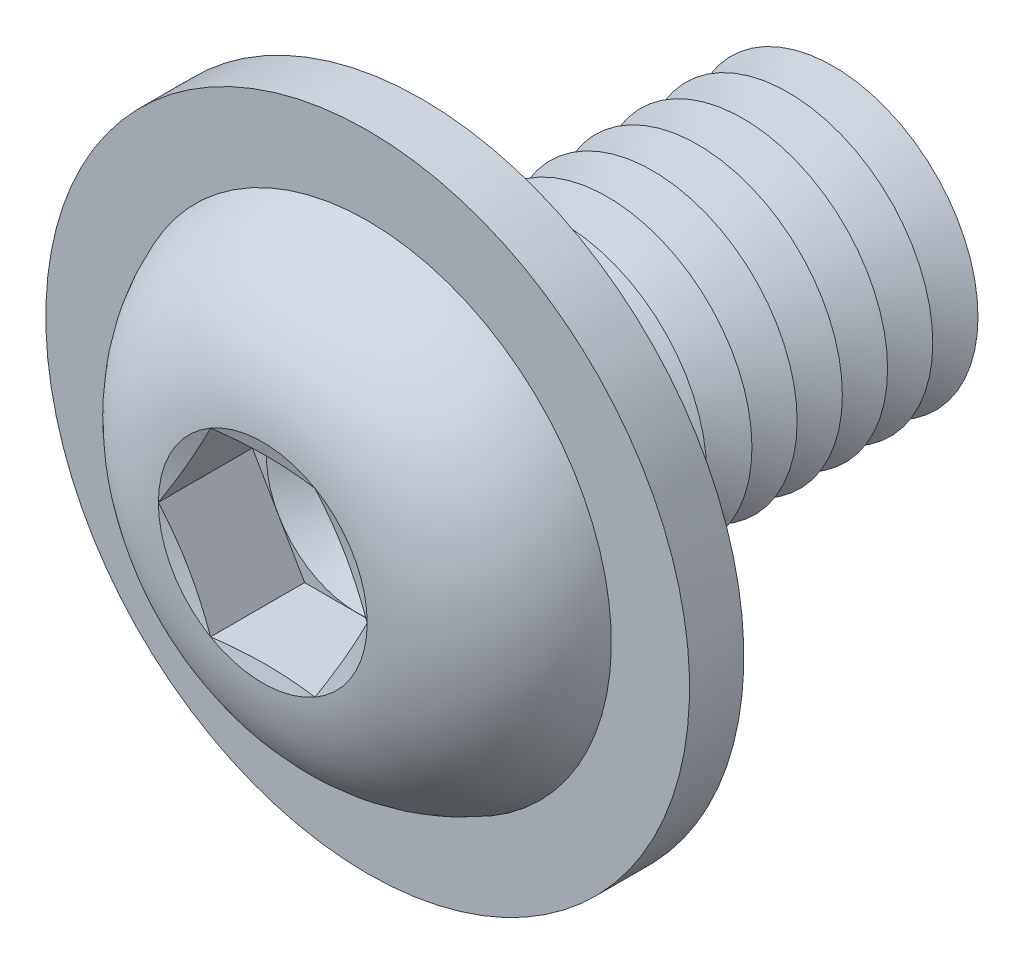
from build123d import *

# Parameters (mm, degrees)
FILLET1_R           = 0.625
LPATTERN1_COUNT     = 9
LPATTERN1_PITCH     = 1.25
CUT_EXTRUDE1_DEPTH  = 2.6
SKETCH5_R           = 8.9
SKETCH5_R_2         = 4.625
BOSS_EXTRUDE1_DEPTH = 1.5


with BuildPart() as part:
    # Sketch1 → Revolve1 (revolve)
    with BuildSketch(Plane(origin=(0, 0, 0), x_dir=(0, 0, -1), z_dir=(1, 0, 0)), mode=Mode.PRIVATE) as revolve1_sk:
        with BuildLine():
            Line((0, 4), (0, 7))
            ThreePointArc((0, 7), (-3.011595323, 5.81154966), (-4.4, 2.88675))
            Line((-4.4, 2.88675), (-4.013248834, 1.443375))
            Line((-4.013248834, 1.443375), (-4.4, 1.443375))
            Line((-4.4, 1.443375), (-4.4, 0))
            Line((-4.4, 0), (12, 0))
            Line((12, 0), (12, 4))
            Line((12, 4), (0, 4))
        make_face()
    revolve(revolve1_sk.sketch.rotate(Axis((0, 0, -12), (0, 0, 1)), 90), axis=Axis((0, 0, -12), (0, 0, 1)))

    # Fillet1
    fillet1_edges = [part.edges().sort_by_distance(p)[0] for p in [
        (4, 0, 0),
    ]]
    fillet(fillet1_edges, radius=FILLET1_R)

    # Sketch2 → Cut-Revolve1 (revolve, cut)
    with BuildSketch(Plane(origin=(0, 0, 0), x_dir=(0, 0, -1), z_dir=(1, 0, 0)), mode=Mode.PRIVATE) as cut_revolve1_sk:
        Polygon((11.375, 4), (12.625, 4), (12, 2.917468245), align=None)
    cut_revolve1 = revolve(cut_revolve1_sk.sketch.rotate(Axis((0, 0, -12), (0, 0, -1)), 270), axis=Axis((0, 0, -12), (0, 0, -1)), mode=Mode.SUBTRACT)

    # LPattern1: Cut-Revolve1 ×9
    with Locations(*[(0, 0, i * LPATTERN1_PITCH) for i in range(1, LPATTERN1_COUNT)]):
        add(cut_revolve1, mode=Mode.SUBTRACT)

    # Sketch3 → Cut-Extrude1 (cut)
    with BuildSketch(Plane.XY.offset(4.4)):
        Polygon((1.443375, 2.499998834), (-1.443375, 2.499998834), (-2.88675, 0), (-1.443375, -2.499998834), (1.443375, -2.499998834), (2.88675, 0), align=None)
    extrude(amount=-CUT_EXTRUDE1_DEPTH, mode=Mode.SUBTRACT)

    # Cut-Extrude2 cone 1 section (on through the dimple's axis) → Cut-Extrude2 (revolve, cut)
    with BuildSketch(Plane(origin=(0, 0, 1.8), x_dir=(0, -1, 0), z_dir=(1, 0, 0))):
        Polygon((0, 0), (2.499998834, 0), (0, 1.443375), align=None)
    revolve(axis=Axis((0, 0, 1.8), (0, 0, -1)), mode=Mode.SUBTRACT)

    # Sketch5 → Boss-Extrude1 (add)
    with BuildSketch(Plane(origin=(0, 0, 0), x_dir=(-1, 0, 0), z_dir=(0, 0, -1))):
        with Locations(Location((0, 0, 0), (0, 0, 90))):
            Circle(SKETCH5_R)
        Circle(SKETCH5_R_2, mode=Mode.SUBTRACT)
    extrude(amount=-BOSS_EXTRUDE1_DEPTH)


solid = part.part
